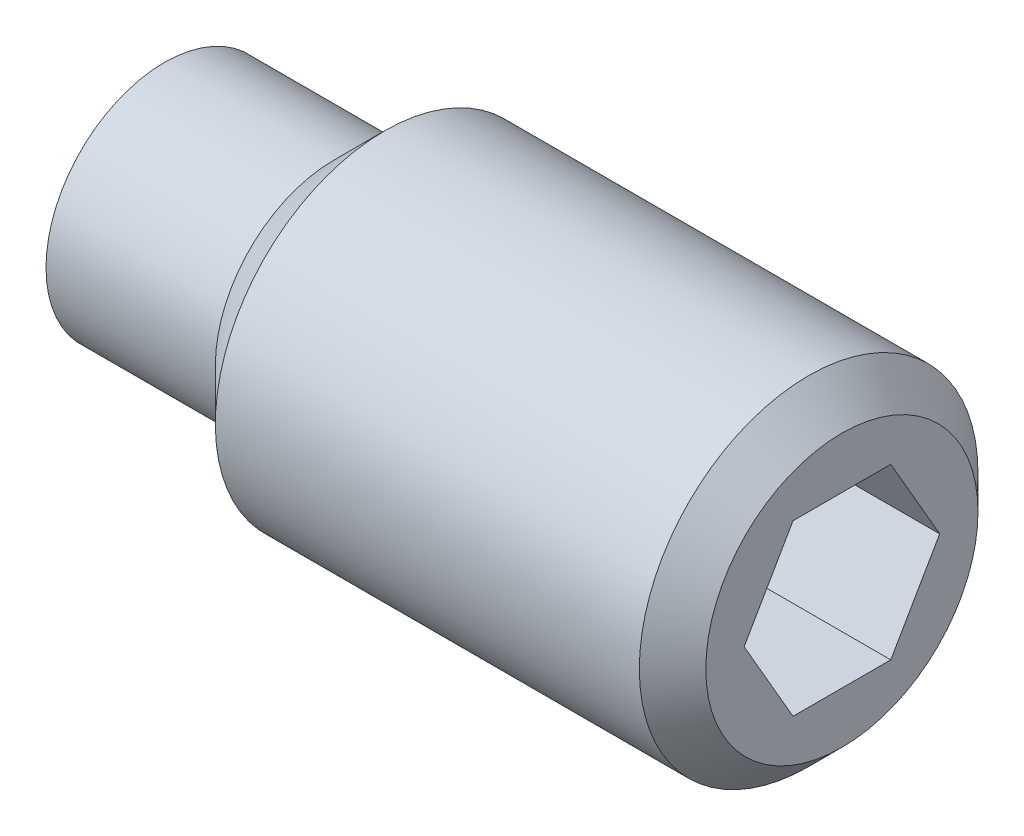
ISO-10303-21;
HEADER;
FILE_DESCRIPTION(('STEP AP214'),'2;1');
FILE_NAME('part.step','',(''),(''),'','','');
FILE_SCHEMA(('AUTOMOTIVE_DESIGN { 1 0 10303 214 1 1 1 1 }'));
ENDSEC;
DATA;
#1=APPLICATION_CONTEXT('core data for automotive mechanical design processes');
#2=APPLICATION_PROTOCOL_DEFINITION('international standard','automotive_design',2000,#1);
#3=PRODUCT_CONTEXT('',#1,'mechanical');
#4=PRODUCT('Part','Part','',(#3));
#5=PRODUCT_RELATED_PRODUCT_CATEGORY('part','',(#4));
#6=PRODUCT_DEFINITION_FORMATION('','',#4);
#7=PRODUCT_DEFINITION_CONTEXT('part definition',#1,'design');
#8=PRODUCT_DEFINITION('design','',#6,#7);
#9=PRODUCT_DEFINITION_SHAPE('','',#8);
#10=(LENGTH_UNIT() NAMED_UNIT(*) SI_UNIT(.MILLI.,.METRE.));
#11=(NAMED_UNIT(*) PLANE_ANGLE_UNIT() SI_UNIT($,.RADIAN.));
#12=(NAMED_UNIT(*) SI_UNIT($,.STERADIAN.) SOLID_ANGLE_UNIT());
#13=UNCERTAINTY_MEASURE_WITH_UNIT(LENGTH_MEASURE(1.E-05),#10,'distance_accuracy_value','');
#14=(GEOMETRIC_REPRESENTATION_CONTEXT(3) GLOBAL_UNCERTAINTY_ASSIGNED_CONTEXT((#13)) GLOBAL_UNIT_ASSIGNED_CONTEXT((#10,
#11,#12)) REPRESENTATION_CONTEXT('',''));
#15=CARTESIAN_POINT('',(0.,0.,0.));
#16=DIRECTION('',(0.,0.,1.));
#17=DIRECTION('',(1.,0.,0.));
#18=AXIS2_PLACEMENT_3D('',#15,#16,#17);
#19=CARTESIAN_POINT('',(10.,-1.25,0.721687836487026));
#20=DIRECTION('',(0.,-1.,0.));
#21=DIRECTION('',(0.,0.,-1.));
#22=AXIS2_PLACEMENT_3D('',#19,#20,#21);
#23=PLANE('',#22);
#24=DIRECTION('',(1.,0.,0.));
#25=VECTOR('',#24,1.);
#26=CARTESIAN_POINT('',(10.,-1.25,0.721687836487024));
#27=LINE('',#26,#25);
#28=CARTESIAN_POINT('',(7.00000000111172,-1.24999999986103,0.721687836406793));
#29=VERTEX_POINT('',#28);
#30=CARTESIAN_POINT('',(10.,-1.25,0.721687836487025));
#31=VERTEX_POINT('',#30);
#32=EDGE_CURVE('E76',#29,#31,#27,.T.);
#33=ORIENTED_EDGE('',*,*,#32,.T.);
#34=DIRECTION('',(0.,0.,-1.));
#35=VECTOR('',#34,1.);
#36=CARTESIAN_POINT('',(10.,-1.25,0.721687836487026));
#37=LINE('',#36,#35);
#38=CARTESIAN_POINT('',(10.,-1.24999999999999,-0.721687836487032));
#39=VERTEX_POINT('',#38);
#40=EDGE_CURVE('E82',#39,#31,#37,.F.);
#41=ORIENTED_EDGE('',*,*,#40,.F.);
#42=DIRECTION('',(1.,0.,0.));
#43=VECTOR('',#42,1.);
#44=CARTESIAN_POINT('',(10.,-1.24999999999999,-0.721687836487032));
#45=LINE('',#44,#43);
#46=CARTESIAN_POINT('',(7.00000000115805,-1.24999999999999,-0.721687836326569));
#47=VERTEX_POINT('',#46);
#48=EDGE_CURVE('E79',#39,#47,#45,.F.);
#49=ORIENTED_EDGE('',*,*,#48,.T.);
#50=CARTESIAN_POINT('',(7.00000000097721,-1.25000000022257,0.721687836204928));
#51=CARTESIAN_POINT('',(6.9816847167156,-1.25000000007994,0.658260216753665));
#52=CARTESIAN_POINT('',(6.96502792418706,-1.25000000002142,0.594285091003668));
#53=CARTESIAN_POINT('',(6.93595399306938,-1.24999999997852,0.465227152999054));
#54=CARTESIAN_POINT('',(6.92354713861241,-1.24999999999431,0.400142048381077));
#55=CARTESIAN_POINT('',(6.90423497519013,-1.25000000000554,0.270778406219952));
#56=CARTESIAN_POINT('',(6.89720111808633,-1.25000000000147,0.206519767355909));
#57=CARTESIAN_POINT('',(6.88880573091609,-1.24999999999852,0.0777002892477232));
#58=CARTESIAN_POINT('',(6.88743724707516,-1.24999999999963,0.013139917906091));
#59=CARTESIAN_POINT('',(6.89029143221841,-1.25000000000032,-0.107484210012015));
#60=CARTESIAN_POINT('',(6.89381330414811,-1.25000000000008,-0.163566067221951));
#61=CARTESIAN_POINT('',(6.90497331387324,-1.24999999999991,-0.275364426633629));
#62=CARTESIAN_POINT('',(6.912615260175,-1.24999999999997,-0.331080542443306));
#63=CARTESIAN_POINT('',(6.93171864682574,-1.25000000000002,-0.443109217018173));
#64=CARTESIAN_POINT('',(6.94326102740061,-1.25000000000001,-0.499407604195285));
#65=CARTESIAN_POINT('',(6.96945735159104,-1.24999999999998,-0.611164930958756));
#66=CARTESIAN_POINT('',(6.98410514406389,-1.24999999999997,-0.666625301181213));
#67=CARTESIAN_POINT('',(7.00000000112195,-1.25,-0.721687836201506));
#68=B_SPLINE_CURVE_WITH_KNOTS('',3,(#50,#51,#52,#53,#54,#55,#56,#57,#58,#59,#60,#61,#62,#63,#64,
#65,#66,#67),.UNSPECIFIED.,.F.,.F.,(4,2,2,2,2,2,2,2,4),(0.,0.198135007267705,0.396746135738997,
0.590442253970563,0.783900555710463,0.952317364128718,1.12089012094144,1.29320101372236,
1.46517373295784),.UNSPECIFIED.);
#69=EDGE_CURVE('E20',#29,#47,#68,.T.);
#70=ORIENTED_EDGE('',*,*,#69,.F.);
#71=EDGE_LOOP('',(#33,#41,#49,#70));
#72=FACE_BOUND('',#71,.T.);
#73=ADVANCED_FACE('F16',(#72),#23,.F.);
#74=CARTESIAN_POINT('',(10.,0.,1.44337567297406));
#75=DIRECTION('',(0.,-0.500000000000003,0.866025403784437));
#76=DIRECTION('',(0.,-0.866025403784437,-0.500000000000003));
#77=AXIS2_PLACEMENT_3D('',#74,#75,#76);
#78=PLANE('',#77);
#79=DIRECTION('',(1.,0.,0.));
#80=VECTOR('',#79,1.);
#81=CARTESIAN_POINT('',(10.,0.,1.44337567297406));
#82=LINE('',#81,#80);
#83=CARTESIAN_POINT('',(7.00000000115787,-1.39498538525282E-10,1.44337567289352));
#84=VERTEX_POINT('',#83);
#85=CARTESIAN_POINT('',(10.,0.,1.44337567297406));
#86=VERTEX_POINT('',#85);
#87=EDGE_CURVE('E147',#84,#86,#82,.T.);
#88=ORIENTED_EDGE('',*,*,#87,.T.);
#89=DIRECTION('',(0.,-0.866025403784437,-0.500000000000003));
#90=VECTOR('',#89,1.);
#91=CARTESIAN_POINT('',(10.,0.,1.44337567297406));
#92=LINE('',#91,#90);
#93=EDGE_CURVE('E92',#31,#86,#92,.F.);
#94=ORIENTED_EDGE('',*,*,#93,.F.);
#95=ORIENTED_EDGE('',*,*,#32,.F.);
#96=CARTESIAN_POINT('',(7.00000000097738,-3.56352714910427E-10,1.44337567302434));
#97=CARTESIAN_POINT('',(6.98168471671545,-0.0549299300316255,1.41166186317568));
#98=CARTESIAN_POINT('',(6.96502792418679,-0.110334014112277,1.37967430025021));
#99=CARTESIAN_POINT('',(6.93595399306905,-0.222101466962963,1.31514533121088));
#100=CARTESIAN_POINT('',(6.92354713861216,-0.278466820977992,1.2826027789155));
#101=CARTESIAN_POINT('',(6.90423497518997,-0.390499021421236,1.2179209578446));
#102=CARTESIAN_POINT('',(6.8972011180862,-0.446148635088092,1.18579163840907));
#103=CARTESIAN_POINT('',(6.88880573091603,-0.557709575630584,1.12138189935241));
#104=CARTESIAN_POINT('',(6.88743724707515,-0.613620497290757,1.08910171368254));
#105=CARTESIAN_POINT('',(6.89029143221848,-0.71808405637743,1.02878964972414));
#106=CARTESIAN_POINT('',(6.89381330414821,-0.766652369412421,1.00074872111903));
#107=CARTESIAN_POINT('',(6.90497331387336,-0.863472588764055,0.944849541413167));
#108=CARTESIAN_POINT('',(6.91261526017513,-0.911724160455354,0.916991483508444));
#109=CARTESIAN_POINT('',(6.93171864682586,-1.0087438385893,0.860977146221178));
#110=CARTESIAN_POINT('',(6.94326102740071,-1.05749967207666,0.832827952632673));
#111=CARTESIAN_POINT('',(6.9694573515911,-1.15428435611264,0.776949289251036));
#112=CARTESIAN_POINT('',(6.98410514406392,-1.20231444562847,0.749219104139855));
#113=CARTESIAN_POINT('',(7.00000000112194,-1.24999999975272,0.721687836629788));
#114=B_SPLINE_CURVE_WITH_KNOTS('',3,(#96,#97,#98,#99,#100,#101,#102,#103,#104,#105,#106,#107,
#108,#109,#110,#111,#112,#113),.UNSPECIFIED.,.F.,.F.,(4,2,2,2,2,2,2,2,4),(0.,0.198135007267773,
0.396746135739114,0.590442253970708,0.783900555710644,0.952317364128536,1.12089012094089,
1.29320101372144,1.46517373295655),.UNSPECIFIED.);
#115=EDGE_CURVE('E84',#84,#29,#114,.T.);
#116=ORIENTED_EDGE('',*,*,#115,.F.);
#117=EDGE_LOOP('',(#88,#94,#95,#116));
#118=FACE_BOUND('',#117,.T.);
#119=ADVANCED_FACE('F93',(#118),#78,.F.);
#120=CARTESIAN_POINT('',(10.,-1.24999999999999,-0.721687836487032));
#121=DIRECTION('',(0.,-0.499999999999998,-0.86602540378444));
#122=DIRECTION('',(0.,0.86602540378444,-0.499999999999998));
#123=AXIS2_PLACEMENT_3D('',#120,#121,#122);
#124=PLANE('',#123);
#125=ORIENTED_EDGE('',*,*,#48,.F.);
#126=DIRECTION('',(0.,0.86602540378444,-0.499999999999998));
#127=VECTOR('',#126,1.);
#128=CARTESIAN_POINT('',(10.,-1.24999999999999,-0.721687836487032));
#129=LINE('',#128,#127);
#130=CARTESIAN_POINT('',(10.,0.,-1.44337567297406));
#131=VERTEX_POINT('',#130);
#132=EDGE_CURVE('E91',#131,#39,#129,.F.);
#133=ORIENTED_EDGE('',*,*,#132,.F.);
#134=DIRECTION('',(1.,0.,0.));
#135=VECTOR('',#134,1.);
#136=CARTESIAN_POINT('',(10.,0.,-1.44337567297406));
#137=LINE('',#136,#135);
#138=CARTESIAN_POINT('',(6.99999999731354,-1.16724756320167E-08,-1.44337566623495));
#139=VERTEX_POINT('',#138);
#140=EDGE_CURVE('E207',#131,#139,#137,.F.);
#141=ORIENTED_EDGE('',*,*,#140,.T.);
#142=CARTESIAN_POINT('',(7.00000000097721,-1.24999999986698,-0.721687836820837));
#143=CARTESIAN_POINT('',(6.98168471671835,-1.19507007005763,-0.75340164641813));
#144=CARTESIAN_POINT('',(6.96502792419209,-1.13966598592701,-0.785389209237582));
#145=CARTESIAN_POINT('',(6.93595399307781,-1.02789853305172,-0.849918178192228));
#146=CARTESIAN_POINT('',(6.92354713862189,-0.971533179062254,-0.882460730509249));
#147=CARTESIAN_POINT('',(6.90423497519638,-0.859500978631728,-0.947142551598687));
#148=CARTESIAN_POINT('',(6.89720111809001,-0.803851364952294,-0.979271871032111));
#149=CARTESIAN_POINT('',(6.88880573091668,-0.692290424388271,-1.04368161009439));
#150=CARTESIAN_POINT('',(6.88743724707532,-0.636379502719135,-1.07596179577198));
#151=CARTESIAN_POINT('',(6.89029143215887,-0.531915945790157,-1.13627385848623));
#152=CARTESIAN_POINT('',(6.89381330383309,-0.483347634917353,-1.16431478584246));
#153=CARTESIAN_POINT('',(6.90497331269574,-0.386527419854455,-1.22021396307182));
#154=CARTESIAN_POINT('',(6.91261525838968,-0.33827585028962,-1.24807201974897));
#155=CARTESIAN_POINT('',(6.93171864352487,-0.241256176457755,-1.30408635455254));
#156=CARTESIAN_POINT('',(6.94326102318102,-0.192500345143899,-1.33223554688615));
#157=CARTESIAN_POINT('',(6.96945734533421,-0.0957156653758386,-1.38811420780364));
#158=CARTESIAN_POINT('',(6.98410513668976,-0.0476855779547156,-1.41584439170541));
#159=CARTESIAN_POINT('',(6.99999999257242,-2.58958299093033E-08,-1.44337565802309));
#160=B_SPLINE_CURVE_WITH_KNOTS('',3,(#142,#143,#144,#145,#146,#147,#148,#149,#150,#151,#152,
#153,#154,#155,#156,#157,#158,#159),.UNSPECIFIED.,.F.,.F.,(4,2,2,2,2,2,2,2,4),(0.,
0.19813500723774,0.396746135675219,0.59044225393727,0.783900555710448,0.952317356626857,
1.12089010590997,1.29320099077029,1.46517370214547),.UNSPECIFIED.);
#161=EDGE_CURVE('E142',#47,#139,#160,.T.);
#162=ORIENTED_EDGE('',*,*,#161,.F.);
#163=EDGE_LOOP('',(#125,#133,#141,#162));
#164=FACE_BOUND('',#163,.T.);
#165=ADVANCED_FACE('F148',(#164),#124,.F.);
#166=CARTESIAN_POINT('',(10.,1.24999999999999,0.721687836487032));
#167=DIRECTION('',(0.,0.499999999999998,0.86602540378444));
#168=DIRECTION('',(0.,-0.86602540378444,0.499999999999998));
#169=AXIS2_PLACEMENT_3D('',#166,#167,#168);
#170=PLANE('',#169);
#171=DIRECTION('',(1.,0.,0.));
#172=VECTOR('',#171,1.);
#173=CARTESIAN_POINT('',(10.,1.25,0.721687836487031));
#174=LINE('',#173,#172);
#175=CARTESIAN_POINT('',(7.00000000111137,1.2499999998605,0.721687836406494));
#176=VERTEX_POINT('',#175);
#177=CARTESIAN_POINT('',(10.,1.25,0.72168783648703));
#178=VERTEX_POINT('',#177);
#179=EDGE_CURVE('E204',#176,#178,#174,.T.);
#180=ORIENTED_EDGE('',*,*,#179,.T.);
#181=DIRECTION('',(0.,-0.86602540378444,0.499999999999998));
#182=VECTOR('',#181,1.);
#183=CARTESIAN_POINT('',(10.,1.24999999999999,0.721687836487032));
#184=LINE('',#183,#182);
#185=EDGE_CURVE('E211',#86,#178,#184,.F.);
#186=ORIENTED_EDGE('',*,*,#185,.F.);
#187=ORIENTED_EDGE('',*,*,#87,.F.);
#188=CARTESIAN_POINT('',(7.00000000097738,3.56343928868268E-10,1.44337567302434));
#189=CARTESIAN_POINT('',(6.98168471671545,0.0549299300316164,1.41166186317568));
#190=CARTESIAN_POINT('',(6.96502792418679,0.110334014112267,1.37967430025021));
#191=CARTESIAN_POINT('',(6.93595399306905,0.222101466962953,1.31514533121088));
#192=CARTESIAN_POINT('',(6.92354713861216,0.278466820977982,1.2826027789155));
#193=CARTESIAN_POINT('',(6.90423497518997,0.390499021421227,1.21792095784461));
#194=CARTESIAN_POINT('',(6.8972011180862,0.446148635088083,1.18579163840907));
#195=CARTESIAN_POINT('',(6.88880573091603,0.557709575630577,1.12138189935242));
#196=CARTESIAN_POINT('',(6.88743724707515,0.61362049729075,1.08910171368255));
#197=CARTESIAN_POINT('',(6.89029143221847,0.718084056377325,1.0287896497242));
#198=CARTESIAN_POINT('',(6.89381330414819,0.766652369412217,1.00074872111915));
#199=CARTESIAN_POINT('',(6.90497331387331,0.863472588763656,0.9448495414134));
#200=CARTESIAN_POINT('',(6.91261526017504,0.911724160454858,0.916991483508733));
#201=CARTESIAN_POINT('',(6.9317186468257,1.00874383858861,0.860977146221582));
#202=CARTESIAN_POINT('',(6.94326102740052,1.05749967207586,0.832827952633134));
#203=CARTESIAN_POINT('',(6.96945735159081,1.15428435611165,0.77694928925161));
#204=CARTESIAN_POINT('',(6.98410514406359,1.20231444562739,0.749219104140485));
#205=CARTESIAN_POINT('',(7.00000000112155,1.24999999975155,0.721687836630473));
#206=B_SPLINE_CURVE_WITH_KNOTS('',3,(#188,#189,#190,#191,#192,#193,#194,#195,#196,#197,#198,
#199,#200,#201,#202,#203,#204,#205),.UNSPECIFIED.,.F.,.F.,(4,2,2,2,2,2,2,2,4),(0.,
0.198135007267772,0.396746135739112,0.590442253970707,0.783900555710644,0.952317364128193,
1.1208901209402,1.29320101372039,1.46517373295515),.UNSPECIFIED.);
#207=EDGE_CURVE('E87',#84,#176,#206,.T.);
#208=ORIENTED_EDGE('',*,*,#207,.T.);
#209=EDGE_LOOP('',(#180,#186,#187,#208));
#210=FACE_BOUND('',#209,.T.);
#211=ADVANCED_FACE('F151',(#210),#170,.F.);
#212=CARTESIAN_POINT('',(10.,0.,-1.44337567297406));
#213=DIRECTION('',(0.,0.500000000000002,-0.866025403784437));
#214=DIRECTION('',(0.,0.866025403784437,0.500000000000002));
#215=AXIS2_PLACEMENT_3D('',#212,#213,#214);
#216=PLANE('',#215);
#217=ORIENTED_EDGE('',*,*,#140,.F.);
#218=DIRECTION('',(0.,0.866025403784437,0.500000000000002));
#219=VECTOR('',#218,1.);
#220=CARTESIAN_POINT('',(10.,0.,-1.44337567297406));
#221=LINE('',#220,#219);
#222=CARTESIAN_POINT('',(10.,1.25,-0.721687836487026));
#223=VERTEX_POINT('',#222);
#224=EDGE_CURVE('E39',#223,#131,#221,.F.);
#225=ORIENTED_EDGE('',*,*,#224,.F.);
#226=DIRECTION('',(1.,0.,0.));
#227=VECTOR('',#226,1.);
#228=CARTESIAN_POINT('',(10.,1.25,-0.721687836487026));
#229=LINE('',#228,#227);
#230=CARTESIAN_POINT('',(7.00000000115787,1.2499999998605,-0.721687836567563));
#231=VERTEX_POINT('',#230);
#232=EDGE_CURVE('E114',#223,#231,#229,.F.);
#233=ORIENTED_EDGE('',*,*,#232,.T.);
#234=CARTESIAN_POINT('',(7.00000000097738,1.24999999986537,-0.721687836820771));
#235=CARTESIAN_POINT('',(6.98168471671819,1.19507007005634,-0.753401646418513));
#236=CARTESIAN_POINT('',(6.96502792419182,1.13966598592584,-0.785389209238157));
#237=CARTESIAN_POINT('',(6.93595399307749,1.02789853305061,-0.849918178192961));
#238=CARTESIAN_POINT('',(6.92354713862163,0.97153317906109,-0.882460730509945));
#239=CARTESIAN_POINT('',(6.90423497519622,0.859500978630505,-0.947142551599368));
#240=CARTESIAN_POINT('',(6.89720111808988,0.803851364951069,-0.979271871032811));
#241=CARTESIAN_POINT('',(6.88880573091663,0.692290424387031,-1.04368161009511));
#242=CARTESIAN_POINT('',(6.88743724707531,0.636379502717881,-1.0759617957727));
#243=CARTESIAN_POINT('',(6.89029143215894,0.531915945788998,-1.1362738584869));
#244=CARTESIAN_POINT('',(6.89381330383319,0.483347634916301,-1.16431478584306));
#245=CARTESIAN_POINT('',(6.90497331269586,0.386527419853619,-1.2202139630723));
#246=CARTESIAN_POINT('',(6.91261525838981,0.338275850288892,-1.24807201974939));
#247=CARTESIAN_POINT('',(6.93171864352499,0.241256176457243,-1.30408635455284));
#248=CARTESIAN_POINT('',(6.94326102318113,0.192500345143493,-1.33223554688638));
#249=CARTESIAN_POINT('',(6.96945734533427,0.0957156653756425,-1.38811420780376));
#250=CARTESIAN_POINT('',(6.9841051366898,0.0476855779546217,-1.41584439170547));
#251=CARTESIAN_POINT('',(6.99999999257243,2.58958367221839E-08,-1.44337565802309));
#252=B_SPLINE_CURVE_WITH_KNOTS('',3,(#234,#235,#236,#237,#238,#239,#240,#241,#242,#243,#244,
#245,#246,#247,#248,#249,#250,#251),.UNSPECIFIED.,.F.,.F.,(4,2,2,2,2,2,2,2,4),(0.,
0.198135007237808,0.396746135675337,0.590442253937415,0.78390055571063,0.952317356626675,
1.12089010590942,1.29320099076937,1.46517370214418),.UNSPECIFIED.);
#253=EDGE_CURVE('E138',#231,#139,#252,.T.);
#254=ORIENTED_EDGE('',*,*,#253,.T.);
#255=EDGE_LOOP('',(#217,#225,#233,#254));
#256=FACE_BOUND('',#255,.T.);
#257=ADVANCED_FACE('F126',(#256),#216,.F.);
#258=CARTESIAN_POINT('',(7.00500000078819,0.,0.));
#259=DIRECTION('',(1.,0.,0.));
#260=DIRECTION('',(0.,0.,-1.));
#261=AXIS2_PLACEMENT_3D('',#258,#259,#260);
#262=CONICAL_SURFACE('',#261,1.45203592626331,1.04719754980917);
#263=CARTESIAN_POINT('',(6.16666666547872,-1.13686837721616E-10,0.));
#264=VERTEX_POINT('',#263);
#265=VERTEX_LOOP('',#264);
#266=FACE_BOUND('',#265,.T.);
#267=ORIENTED_EDGE('',*,*,#115,.T.);
#268=ORIENTED_EDGE('',*,*,#69,.T.);
#269=ORIENTED_EDGE('',*,*,#161,.T.);
#270=ORIENTED_EDGE('',*,*,#253,.F.);
#271=CARTESIAN_POINT('',(7.00000000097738,1.25000000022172,-0.721687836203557));
#272=CARTESIAN_POINT('',(6.98168471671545,1.25000000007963,-0.658260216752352));
#273=CARTESIAN_POINT('',(6.96502792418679,1.25000000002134,-0.594285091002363));
#274=CARTESIAN_POINT('',(6.93595399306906,1.2499999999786,-0.465227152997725));
#275=CARTESIAN_POINT('',(6.92354713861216,1.24999999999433,-0.400142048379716));
#276=CARTESIAN_POINT('',(6.90423497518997,1.25000000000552,-0.270778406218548));
#277=CARTESIAN_POINT('',(6.8972011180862,1.25000000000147,-0.206519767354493));
#278=CARTESIAN_POINT('',(6.88880573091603,1.24999999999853,-0.0777002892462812));
#279=CARTESIAN_POINT('',(6.88743724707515,1.24999999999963,-0.0131399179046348));
#280=CARTESIAN_POINT('',(6.89029143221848,1.25000000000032,0.107484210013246));
#281=CARTESIAN_POINT('',(6.8938133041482,1.25000000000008,0.163566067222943));
#282=CARTESIAN_POINT('',(6.90497331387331,1.24999999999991,0.275364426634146));
#283=CARTESIAN_POINT('',(6.91261526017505,1.24999999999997,0.331080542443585));
#284=CARTESIAN_POINT('',(6.93171864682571,1.25000000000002,0.443109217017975));
#285=CARTESIAN_POINT('',(6.94326102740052,1.25000000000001,0.499407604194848));
#286=CARTESIAN_POINT('',(6.96945735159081,1.24999999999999,0.611164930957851));
#287=CARTESIAN_POINT('',(6.98410514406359,1.24999999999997,0.666625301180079));
#288=CARTESIAN_POINT('',(7.00000000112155,1.25,0.721687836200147));
#289=B_SPLINE_CURVE_WITH_KNOTS('',3,(#271,#272,#273,#274,#275,#276,#277,#278,#279,#280,#281,
#282,#283,#284,#285,#286,#287,#288),.UNSPECIFIED.,.F.,.F.,(4,2,2,2,2,2,2,2,4),(0.,
0.198135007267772,0.396746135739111,0.590442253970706,0.783900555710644,0.952317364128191,
1.12089012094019,1.29320101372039,1.46517373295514),.UNSPECIFIED.);
#290=EDGE_CURVE('E108',#231,#176,#289,.T.);
#291=ORIENTED_EDGE('',*,*,#290,.T.);
#292=ORIENTED_EDGE('',*,*,#207,.F.);
#293=EDGE_LOOP('',(#267,#268,#269,#270,#291,#292));
#294=FACE_BOUND('',#293,.T.);
#295=ADVANCED_FACE('F85',(#266,#294),#262,.F.);
#296=CARTESIAN_POINT('',(10.,1.25,-0.721687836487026));
#297=DIRECTION('',(0.,1.,0.));
#298=DIRECTION('',(0.,0.,1.));
#299=AXIS2_PLACEMENT_3D('',#296,#297,#298);
#300=PLANE('',#299);
#301=ORIENTED_EDGE('',*,*,#232,.F.);
#302=DIRECTION('',(0.,0.,1.));
#303=VECTOR('',#302,1.);
#304=CARTESIAN_POINT('',(10.,1.25,0.));
#305=LINE('',#304,#303);
#306=EDGE_CURVE('E107',#223,#178,#305,.T.);
#307=ORIENTED_EDGE('',*,*,#306,.T.);
#308=ORIENTED_EDGE('',*,*,#179,.F.);
#309=ORIENTED_EDGE('',*,*,#290,.F.);
#310=EDGE_LOOP('',(#301,#307,#308,#309));
#311=FACE_BOUND('',#310,.T.);
#312=ADVANCED_FACE('F120',(#311),#300,.F.);
#313=CARTESIAN_POINT('',(0.,0.875,0.));
#314=DIRECTION('',(-1.,0.,0.));
#315=DIRECTION('',(0.,0.,1.));
#316=AXIS2_PLACEMENT_3D('',#313,#314,#315);
#317=PLANE('',#316);
#318=CARTESIAN_POINT('',(0.,0.,0.));
#319=DIRECTION('',(1.,0.,0.));
#320=DIRECTION('',(0.,1.,0.));
#321=AXIS2_PLACEMENT_3D('',#318,#319,#320);
#322=CIRCLE('',#321,1.75);
#323=CARTESIAN_POINT('',(0.,1.75,0.));
#324=VERTEX_POINT('',#323);
#325=EDGE_CURVE('E104',#324,#324,#322,.T.);
#326=ORIENTED_EDGE('',*,*,#325,.F.);
#327=EDGE_LOOP('',(#326));
#328=FACE_BOUND('',#327,.T.);
#329=ADVANCED_FACE('F182',(#328),#317,.T.);
#330=CARTESIAN_POINT('',(10.,0.,0.));
#331=DIRECTION('',(-1.,0.,0.));
#332=DIRECTION('',(0.,0.,1.));
#333=AXIS2_PLACEMENT_3D('',#330,#331,#332);
#334=PLANE('',#333);
#335=ORIENTED_EDGE('',*,*,#224,.T.);
#336=ORIENTED_EDGE('',*,*,#132,.T.);
#337=ORIENTED_EDGE('',*,*,#40,.T.);
#338=ORIENTED_EDGE('',*,*,#93,.T.);
#339=ORIENTED_EDGE('',*,*,#185,.T.);
#340=ORIENTED_EDGE('',*,*,#306,.F.);
#341=EDGE_LOOP('',(#335,#336,#337,#338,#339,#340));
#342=FACE_BOUND('',#341,.T.);
#343=CARTESIAN_POINT('',(10.0000000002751,0.,0.));
#344=DIRECTION('',(-1.,0.,0.));
#345=DIRECTION('',(0.,0.,1.));
#346=AXIS2_PLACEMENT_3D('',#343,#344,#345);
#347=CIRCLE('',#346,2.00924000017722);
#348=CARTESIAN_POINT('',(10.0000000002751,0.,2.00924000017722));
#349=VERTEX_POINT('',#348);
#350=EDGE_CURVE('E100',#349,#349,#347,.T.);
#351=ORIENTED_EDGE('',*,*,#350,.F.);
#352=EDGE_LOOP('',(#351));
#353=FACE_BOUND('',#352,.T.);
#354=ADVANCED_FACE('F179',(#342,#353),#334,.F.);
#355=CARTESIAN_POINT('',(1.25,0.,0.));
#356=DIRECTION('',(1.,0.,0.));
#357=DIRECTION('',(0.,1.,0.));
#358=AXIS2_PLACEMENT_3D('',#355,#356,#357);
#359=CYLINDRICAL_SURFACE('',#358,1.75);
#360=ORIENTED_EDGE('',*,*,#325,.T.);
#361=EDGE_LOOP('',(#360));
#362=FACE_BOUND('',#361,.T.);
#363=CARTESIAN_POINT('',(2.49999999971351,0.,0.));
#364=DIRECTION('',(1.,0.,0.));
#365=DIRECTION('',(0.,-1.,0.));
#366=AXIS2_PLACEMENT_3D('',#363,#364,#365);
#367=CIRCLE('',#366,1.75000000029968);
#368=CARTESIAN_POINT('',(2.49999999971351,-1.75000000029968,0.));
#369=VERTEX_POINT('',#368);
#370=EDGE_CURVE('E103',#369,#369,#367,.T.);
#371=ORIENTED_EDGE('',*,*,#370,.F.);
#372=EDGE_LOOP('',(#371));
#373=FACE_BOUND('',#372,.T.);
#374=ADVANCED_FACE('F175',(#362,#373),#359,.T.);
#375=CARTESIAN_POINT('',(9.50923999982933,0.,0.));
#376=DIRECTION('',(-1.,0.,0.));
#377=DIRECTION('',(0.,0.,1.));
#378=AXIS2_PLACEMENT_3D('',#375,#376,#377);
#379=CONICAL_SURFACE('',#378,2.49999999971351,0.78539816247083);
#380=ORIENTED_EDGE('',*,*,#350,.T.);
#381=EDGE_LOOP('',(#380));
#382=FACE_BOUND('',#381,.T.);
#383=CARTESIAN_POINT('',(9.50924,0.,0.));
#384=DIRECTION('',(1.,0.,0.));
#385=DIRECTION('',(0.,1.,0.));
#386=AXIS2_PLACEMENT_3D('',#383,#384,#385);
#387=CIRCLE('',#386,2.5);
#388=CARTESIAN_POINT('',(9.50924,2.5,0.));
#389=VERTEX_POINT('',#388);
#390=EDGE_CURVE('E30',#389,#389,#387,.F.);
#391=ORIENTED_EDGE('',*,*,#390,.F.);
#392=EDGE_LOOP('',(#391));
#393=FACE_BOUND('',#392,.T.);
#394=ADVANCED_FACE('F168',(#382,#393),#379,.T.);
#395=CARTESIAN_POINT('',(3.25000000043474,0.,0.));
#396=DIRECTION('',(1.,0.,0.));
#397=DIRECTION('',(0.,0.,-1.));
#398=AXIS2_PLACEMENT_3D('',#395,#396,#397);
#399=CONICAL_SURFACE('',#398,2.49999999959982,0.785398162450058);
#400=CARTESIAN_POINT('',(3.25,0.,0.));
#401=DIRECTION('',(1.,0.,0.));
#402=DIRECTION('',(0.,1.,0.));
#403=AXIS2_PLACEMENT_3D('',#400,#401,#402);
#404=CIRCLE('',#403,2.5);
#405=CARTESIAN_POINT('',(3.25,2.5,0.));
#406=VERTEX_POINT('',#405);
#407=EDGE_CURVE('E11',#406,#406,#404,.T.);
#408=ORIENTED_EDGE('',*,*,#407,.F.);
#409=EDGE_LOOP('',(#408));
#410=FACE_BOUND('',#409,.T.);
#411=ORIENTED_EDGE('',*,*,#370,.T.);
#412=EDGE_LOOP('',(#411));
#413=FACE_BOUND('',#412,.T.);
#414=ADVANCED_FACE('F162',(#410,#413),#399,.T.);
#415=CARTESIAN_POINT('',(6.25,0.,0.));
#416=DIRECTION('',(1.,0.,0.));
#417=DIRECTION('',(0.,1.,0.));
#418=AXIS2_PLACEMENT_3D('',#415,#416,#417);
#419=CYLINDRICAL_SURFACE('',#418,2.5);
#420=ORIENTED_EDGE('',*,*,#407,.T.);
#421=EDGE_LOOP('',(#420));
#422=FACE_BOUND('',#421,.T.);
#423=ORIENTED_EDGE('',*,*,#390,.T.);
#424=EDGE_LOOP('',(#423));
#425=FACE_BOUND('',#424,.T.);
#426=ADVANCED_FACE('F160',(#422,#425),#419,.T.);
#427=CLOSED_SHELL('',(#73,#119,#165,#211,#257,#295,#312,#329,#354,#374,#394,#414,#426));
#428=MANIFOLD_SOLID_BREP('B1',#427);
#429=ADVANCED_BREP_SHAPE_REPRESENTATION('',(#18,#428),#14);
#430=SHAPE_DEFINITION_REPRESENTATION(#9,#429);
ENDSEC;
END-ISO-10303-21;
